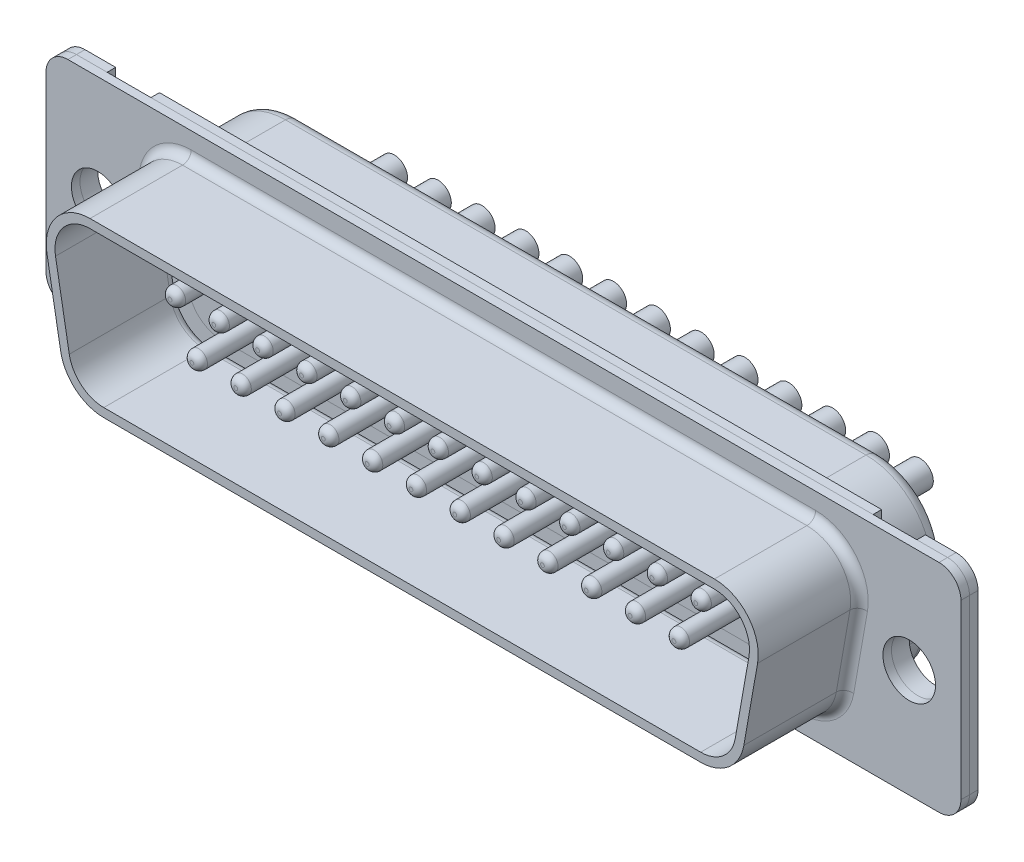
from build123d import *

# Parameters (mm, degrees)
EXTRUDE1_DEPTH                      = 0.4953
EXTRUDE2_DEPTH                      = 5.8674
F_31_0_12_DIAMETER_HOLE1_D          = 3.048
CUT_EXTRUDE1_DEPTH                  = 28.87418266
FILLET1_R                           = 0.508
FILLET2_R                           = 0.508
EXTRUDE3_DEPTH                      = 0.4953
SKETCH7_W                           = 1.524
SKETCH7_H                           = 0.4953
F_31_0_12_DIAMETER_HOLE2_AT_2_COUNT = 2
F_31_0_12_DIAMETER_HOLE2_AT_2_PITCH = 47.0408
EXTRUDE4_DEPTH                      = 3.9624
EXTRUDE5_START                      = 0.5334
SKETCH10_R                          = 2.31775
SKETCH10_R_2                        = 1.524
EXTRUDE5_DEPTH                      = 0.5334
CUT_EXTRUDE2_DEPTH                  = 3.9624
FILLET3_R                           = 0.762
CUT_EXTRUDE3_DEPTH                  = 29.099392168
EXTRUDE7_DEPTH                      = 4.8133
CUT_EXTRUDE4_DEPTH                  = 3.81
SKETCH16_R                          = 1.0795
CUT_EXTRUDE5_DEPTH                  = 1.0033
EXTRUDE8_DEPTH                      = 3.81
SKETCH18_R                          = 0.762
SKETCH18_R_2                        = 0.5588
EXTRUDE10_DEPTH                     = 3.6068
SKETCH19_R                          = 0.508
EXTRUDE11_DEPTH                     = 5.588
FILLET4_R                           = 0.396875
LPATTERN1_COUNT                     = 13
LPATTERN1_PITCH                     = 2.54
LPATTERN2_COUNT                     = 12
LPATTERN2_PITCH                     = 2.54


with BuildPart() as part:
    # Sketch1 → Extrude1 (new body)
    with BuildSketch(Plane.XY):
        with BuildLine():
            Line((-25.2476, -6.2738), (25.2476, -6.2738))
            ThreePointArc((25.2476, -6.2738), (26.145625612, -5.901825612), (26.5176, -5.0038))
            Line((26.5176, -5.0038), (26.5176, 5.0038))
            ThreePointArc((26.5176, 5.0038), (26.145625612, 5.901825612), (25.2476, 6.2738))
            Line((25.2476, 6.2738), (-25.2476, 6.2738))
            ThreePointArc((-25.2476, 6.2738), (-26.145625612, 5.901825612), (-26.5176, 5.0038))
            Line((-26.5176, 5.0038), (-26.5176, -5.0038))
            ThreePointArc((-26.5176, -5.0038), (-26.145625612, -5.901825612), (-25.2476, -6.2738))
        make_face()
    extrude(amount=-EXTRUDE1_DEPTH)

    # Sketch2 → Extrude2 (add)
    with BuildSketch(Plane.XY):
        with BuildLine():
            Line((20.598911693, 1.819533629), (19.801702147, -2.701666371))
            ThreePointArc((19.801702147, -2.701666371), (18.932970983, -4.206352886), (17.300290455, -4.8006))
            Line((17.300290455, -4.8006), (-17.300290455, -4.8006))
            ThreePointArc((-17.300290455, -4.8006), (-18.932970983, -4.206352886), (-19.801702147, -2.701666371))
            Line((-19.801702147, -2.701666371), (-20.598911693, 1.819533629))
            ThreePointArc((-20.598911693, 1.819533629), (-20.043252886, 3.893280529), (-18.0975, 4.8006))
            Line((-18.0975, 4.8006), (18.0975, 4.8006))
            ThreePointArc((18.0975, 4.8006), (20.043252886, 3.893280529), (20.598911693, 1.819533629))
        make_face()
        with BuildLine():
            Line((-18.0975, 4.2926), (18.0975, 4.2926))
            ThreePointArc((18.0975, 4.2926), (19.654102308, 3.566744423), (20.098629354, 1.907746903))
            Line((20.098629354, 1.907746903), (19.301419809, -2.613453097))
            ThreePointArc((19.301419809, -2.613453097), (18.606434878, -3.817202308), (17.300290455, -4.2926))
            Line((17.300290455, -4.2926), (-17.300290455, -4.2926))
            ThreePointArc((-17.300290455, -4.2926), (-18.606434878, -3.817202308), (-19.301419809, -2.613453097))
            Line((-19.301419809, -2.613453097), (-20.098629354, 1.907746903))
            ThreePointArc((-20.098629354, 1.907746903), (-19.654102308, 3.566744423), (-18.0975, 4.2926))
        make_face(mode=Mode.SUBTRACT)
    extrude(amount=EXTRUDE2_DEPTH)

    # 31 _0.12_ Diameter Hole1 (through all)
    with Locations(Plane.XY):
        with Locations((-23.5204, 0), (23.5204, 0)):
            Hole(F_31_0_12_DIAMETER_HOLE1_D / 2)

    # Sketch5 → Cut-Extrude1 (cut, through all)
    with BuildSketch(Plane.XY):
        with BuildLine():
            Line((18.0975, 4.2926), (-18.0975, 4.2926))
            ThreePointArc((-18.0975, 4.2926), (-19.654102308, 3.566744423), (-20.098629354, 1.907746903))
            Line((-20.098629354, 1.907746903), (-19.301419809, -2.613453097))
            ThreePointArc((-19.301419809, -2.613453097), (-18.606434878, -3.817202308), (-17.300290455, -4.2926))
            Line((-17.300290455, -4.2926), (17.300290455, -4.2926))
            ThreePointArc((17.300290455, -4.2926), (18.606434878, -3.817202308), (19.301419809, -2.613453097))
            Line((19.301419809, -2.613453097), (20.098629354, 1.907746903))
            ThreePointArc((20.098629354, 1.907746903), (19.654102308, 3.566744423), (18.0975, 4.2926))
        make_face()
    extrude(amount=-CUT_EXTRUDE1_DEPTH, mode=Mode.SUBTRACT)

    # Fillet1
    fillet1_edges = [part.edges().sort_by_distance(p)[0] for p in [
        (20.043252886, 3.893280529, 0),
        (0, 4.8006, 0),
        (-20.043252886, 3.893280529, 0),
        (-20.20030692, -0.441066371, 0),
        (-18.932970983, -4.206352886, 0),
        (0, -4.8006, 0),
        (18.932970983, -4.206352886, 0),
        (20.20030692, -0.441066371, 0),
    ]]
    fillet(fillet1_edges, radius=FILLET1_R)

    # Fillet2
    fillet2_edges = [part.edges().sort_by_distance(p)[0] for p in [
        (19.654102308, 3.566744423, -0.4953),
        (19.700024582, -0.352853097, -0.4953),
        (18.606434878, -3.817202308, -0.4953),
        (0, -4.2926, -0.4953),
        (-18.606434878, -3.817202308, -0.4953),
        (-19.700024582, -0.352853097, -0.4953),
        (-19.654102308, 3.566744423, -0.4953),
        (0, 4.2926, -0.4953),
    ]]
    fillet(fillet2_edges, radius=FILLET2_R)


with BuildPart() as body_2:
    # Sketch6 → Extrude3 (new body)
    with BuildSketch(Plane(origin=(0, 0, -0.4953), x_dir=(-1, 0, 0), z_dir=(0, 0, -1))):
        with BuildLine():
            Line((-23.4696, -6.2738), (-23.4696, -4.6228))
            Line((-23.4696, -4.6228), (-20.9296, -4.6228))
            Line((-20.9296, -4.6228), (-20.9296, -6.2738))
            Line((-20.9296, -6.2738), (20.9296, -6.2738))
            Line((20.9296, -6.2738), (20.9296, -4.6228))
            Line((20.9296, -4.6228), (23.4696, -4.6228))
            Line((23.4696, -4.6228), (23.4696, -6.2738))
            Line((23.4696, -6.2738), (25.2476, -6.2738))
            ThreePointArc((25.2476, -6.2738), (26.145625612, -5.901825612), (26.5176, -5.0038))
            Line((26.5176, -5.0038), (26.5176, 5.0038))
            ThreePointArc((26.5176, 5.0038), (26.145625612, 5.901825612), (25.2476, 6.2738))
            Line((25.2476, 6.2738), (23.4696, 6.2738))
            Line((23.4696, 6.2738), (23.4696, 4.6228))
            Line((23.4696, 4.6228), (20.9296, 4.6228))
            Line((20.9296, 4.6228), (20.9296, 6.2738))
            Line((20.9296, 6.2738), (-20.9296, 6.2738))
            Line((-20.9296, 6.2738), (-20.9296, 4.6228))
            Line((-20.9296, 4.6228), (-23.4696, 4.6228))
            Line((-23.4696, 4.6228), (-23.4696, 6.2738))
            Line((-23.4696, 6.2738), (-25.2476, 6.2738))
            ThreePointArc((-25.2476, 6.2738), (-26.145625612, 5.901825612), (-26.5176, 5.0038))
            Line((-26.5176, 5.0038), (-26.5176, -5.0038))
            ThreePointArc((-26.5176, -5.0038), (-26.145625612, -5.901825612), (-25.2476, -6.2738))
            Line((-25.2476, -6.2738), (-23.4696, -6.2738))
        make_face()
    extrude(amount=EXTRUDE3_DEPTH)

    # Sketch7 → 31 _0.12_ Diameter Hole2 (revolve, cut)
    with BuildSketch(Plane(origin=(-23.5204, 0, -0.4953), x_dir=(0, -1, 0), z_dir=(1, 0, 0))):
        with Locations((0.762, 0.24765)):
            Rectangle(SKETCH7_W, SKETCH7_H)
    f_31_0_12_diameter_hole2 = revolve(axis=Axis((-23.5204, 0, 5.8547), (0, 0, -1)), mode=Mode.SUBTRACT)

    # 31 _0.12_ Diameter Hole2 at 2: 31 _0.12_ Diameter Hole2 ×2
    with Locations(*[(i * F_31_0_12_DIAMETER_HOLE2_AT_2_PITCH, 0, 0) for i in range(1, F_31_0_12_DIAMETER_HOLE2_AT_2_COUNT)]):
        add(f_31_0_12_diameter_hole2, mode=Mode.SUBTRACT)

    # Sketch9 → Extrude4 (add)
    with BuildSketch(Plane(origin=(0, 0, -0.9906), x_dir=(-1, 0, 0), z_dir=(0, 0, -1))):
        with BuildLine():
            Line((-20.579617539, 0.887800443), (-20.033215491, -2.210999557))
            ThreePointArc((-20.033215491, -2.210999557), (-18.730118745, -4.468029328), (-16.281097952, -5.3594))
            Line((-16.281097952, -5.3594), (16.281097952, -5.3594))
            ThreePointArc((16.281097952, -5.3594), (18.730118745, -4.468029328), (20.033215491, -2.210999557))
            Line((20.033215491, -2.210999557), (20.579617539, 0.887800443))
            ThreePointArc((20.579617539, 0.887800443), (19.746129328, 3.998420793), (16.8275, 5.3594))
            Line((16.8275, 5.3594), (-16.8275, 5.3594))
            ThreePointArc((-16.8275, 5.3594), (-19.746129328, 3.998420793), (-20.579617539, 0.887800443))
        make_face()
    extrude(amount=EXTRUDE4_DEPTH)

    # Sketch10 → Extrude5 (add)
    # profile 1 of 2: a face of its own
    with BuildSketch(Plane(origin=(0, 0, -0.9906), x_dir=(-1, 0, 0), z_dir=(0, 0, -1)).offset(EXTRUDE5_START)):
        with Locations(Location((-23.5204, 0, 0), (0, 0, 180))):
            Circle(SKETCH10_R)
        with Locations(Location((-23.5204, 0, 0), (0, 0, 180))):
            Circle(SKETCH10_R_2, mode=Mode.SUBTRACT)
    # profile 2 of 2: a face of its own
    with BuildSketch(Plane(origin=(0, 0, -0.9906), x_dir=(-1, 0, 0), z_dir=(0, 0, -1)).offset(EXTRUDE5_START)):
        with Locations(Location((23.5204, 0, 0), (0, 0, 180))):
            Circle(SKETCH10_R)
        with Locations(Location((23.5204, 0, 0), (0, 0, 180))):
            Circle(SKETCH10_R_2, mode=Mode.SUBTRACT)
    extrude(amount=-EXTRUDE5_DEPTH)

    # Sketch11 → Cut-Extrude2 (cut)
    with BuildSketch(Plane(origin=(0, 0, -4.953), x_dir=(-1, 0, 0), z_dir=(0, 0, -1))):
        with BuildLine():
            Line((17.539476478, 3.8354), (-17.539476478, 3.8354))
            ThreePointArc((-17.539476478, 3.8354), (-18.998791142, 3.154910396), (-19.415535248, 1.599600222))
            Line((-19.415535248, 1.599600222), (-18.734772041, -2.261199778))
            ThreePointArc((-18.734772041, -2.261199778), (-18.083223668, -3.389714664), (-16.858713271, -3.8354))
            Line((-16.858713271, -3.8354), (16.858713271, -3.8354))
            ThreePointArc((16.858713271, -3.8354), (18.083223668, -3.389714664), (18.734772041, -2.261199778))
            Line((18.734772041, -2.261199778), (19.415535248, 1.599600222))
            ThreePointArc((19.415535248, 1.599600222), (18.998791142, 3.154910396), (17.539476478, 3.8354))
        make_face()
    extrude(amount=-CUT_EXTRUDE2_DEPTH, mode=Mode.SUBTRACT)

    # Fillet3
    fillet3_edges = [body_2.edges().sort_by_distance(p)[0] for p in [
        (0, 5.3594, -4.953),
        (19.746129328, 3.998420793, -4.953),
        (20.306416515, -0.661599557, -4.953),
        (18.730118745, -4.468029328, -4.953),
        (0, -5.3594, -4.953),
        (-18.730118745, -4.468029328, -4.953),
        (-20.306416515, -0.661599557, -4.953),
        (-19.746129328, 3.998420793, -4.953),
    ]]
    fillet(fillet3_edges, radius=FILLET3_R)

    # Sketch14 → Cut-Extrude3 (cut, through all)
    with BuildSketch(Plane(origin=(0, 0, -0.9906), x_dir=(-1, 0, 0), z_dir=(0, 0, -1))):
        with BuildLine():
            Line((17.539476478, 3.8354), (-17.539476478, 3.8354))
            ThreePointArc((-17.539476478, 3.8354), (-18.998791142, 3.154910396), (-19.415535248, 1.599600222))
            Line((-19.415535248, 1.599600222), (-18.734772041, -2.261199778))
            ThreePointArc((-18.734772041, -2.261199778), (-18.083223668, -3.389714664), (-16.858713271, -3.8354))
            Line((-16.858713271, -3.8354), (16.858713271, -3.8354))
            ThreePointArc((16.858713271, -3.8354), (18.083223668, -3.389714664), (18.734772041, -2.261199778))
            Line((18.734772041, -2.261199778), (19.415535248, 1.599600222))
            ThreePointArc((19.415535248, 1.599600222), (18.998791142, 3.154910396), (17.539476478, 3.8354))
        make_face()
    extrude(amount=-CUT_EXTRUDE3_DEPTH, mode=Mode.SUBTRACT)


with BuildPart() as body_3:
    # Sketch13 → Extrude7 (new body)
    with BuildSketch(Plane(origin=(0, 0, -0.4953), x_dir=(-1, 0, 0), z_dir=(0, 0, -1))):
        with BuildLine():
            Line((17.539476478, 3.8354), (-17.539476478, 3.8354))
            ThreePointArc((-17.539476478, 3.8354), (-18.998791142, 3.154910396), (-19.415535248, 1.599600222))
            Line((-19.415535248, 1.599600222), (-18.734772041, -2.261199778))
            ThreePointArc((-18.734772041, -2.261199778), (-18.083223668, -3.389714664), (-16.858713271, -3.8354))
            Line((-16.858713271, -3.8354), (16.858713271, -3.8354))
            ThreePointArc((16.858713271, -3.8354), (18.083223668, -3.389714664), (18.734772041, -2.261199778))
            Line((18.734772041, -2.261199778), (19.415535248, 1.599600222))
            ThreePointArc((19.415535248, 1.599600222), (18.998791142, 3.154910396), (17.539476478, 3.8354))
        make_face()
    extrude(amount=EXTRUDE7_DEPTH)

    # Sketch15 → Cut-Extrude4 (cut)
    with BuildSketch(Plane(origin=(0, 0, -5.3086), x_dir=(-1, 0, 0), z_dir=(0, 0, -1))):
        with BuildLine():
            Line((-16.1798, 1.801127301), (-16.1798, 0.738872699))
            ThreePointArc((-16.1798, 0.738872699), (-15.24, 0.1905), (-14.3002, 0.738872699))
            Line((-14.3002, 0.738872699), (-14.3002, 1.801127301))
            ThreePointArc((-14.3002, 1.801127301), (-15.24, 2.3495), (-16.1798, 1.801127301))
        make_face()
        with BuildLine():
            Line((-11.7602, 1.801127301), (-11.7602, 0.738872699))
            ThreePointArc((-11.7602, 0.738872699), (-12.7, 0.1905), (-13.6398, 0.738872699))
            Line((-13.6398, 0.738872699), (-13.6398, 1.801127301))
            ThreePointArc((-13.6398, 1.801127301), (-12.7, 2.3495), (-11.7602, 1.801127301))
        make_face()
        with BuildLine():
            Line((-9.2202, 1.801127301), (-9.2202, 0.738872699))
            ThreePointArc((-9.2202, 0.738872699), (-10.16, 0.1905), (-11.0998, 0.738872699))
            Line((-11.0998, 0.738872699), (-11.0998, 1.801127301))
            ThreePointArc((-11.0998, 1.801127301), (-10.16, 2.3495), (-9.2202, 1.801127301))
        make_face()
        with BuildLine():
            Line((-6.6802, 1.801127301), (-6.6802, 0.738872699))
            ThreePointArc((-6.6802, 0.738872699), (-7.62, 0.1905), (-8.5598, 0.738872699))
            Line((-8.5598, 0.738872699), (-8.5598, 1.801127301))
            ThreePointArc((-8.5598, 1.801127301), (-7.62, 2.3495), (-6.6802, 1.801127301))
        make_face()
        with BuildLine():
            Line((-4.1402, 1.801127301), (-4.1402, 0.738872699))
            ThreePointArc((-4.1402, 0.738872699), (-5.08, 0.1905), (-6.0198, 0.738872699))
            Line((-6.0198, 0.738872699), (-6.0198, 1.801127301))
            ThreePointArc((-6.0198, 1.801127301), (-5.08, 2.3495), (-4.1402, 1.801127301))
        make_face()
        with BuildLine():
            Line((-1.6002, 1.801127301), (-1.6002, 0.738872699))
            ThreePointArc((-1.6002, 0.738872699), (-2.54, 0.1905), (-3.4798, 0.738872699))
            Line((-3.4798, 0.738872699), (-3.4798, 1.801127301))
            ThreePointArc((-3.4798, 1.801127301), (-2.54, 2.3495), (-1.6002, 1.801127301))
        make_face()
        with BuildLine():
            Line((0.9398, 1.801127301), (0.9398, 0.738872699))
            ThreePointArc((0.9398, 0.738872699), (0, 0.1905), (-0.9398, 0.738872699))
            Line((-0.9398, 0.738872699), (-0.9398, 1.801127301))
            ThreePointArc((-0.9398, 1.801127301), (0, 2.3495), (0.9398, 1.801127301))
        make_face()
        with BuildLine():
            Line((3.4798, 1.801127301), (3.4798, 0.738872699))
            ThreePointArc((3.4798, 0.738872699), (2.54, 0.1905), (1.6002, 0.738872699))
            Line((1.6002, 0.738872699), (1.6002, 1.801127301))
            ThreePointArc((1.6002, 1.801127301), (2.54, 2.3495), (3.4798, 1.801127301))
        make_face()
        with BuildLine():
            Line((6.0198, 1.801127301), (6.0198, 0.738872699))
            ThreePointArc((6.0198, 0.738872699), (5.08, 0.1905), (4.1402, 0.738872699))
            Line((4.1402, 0.738872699), (4.1402, 1.801127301))
            ThreePointArc((4.1402, 1.801127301), (5.08, 2.3495), (6.0198, 1.801127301))
        make_face()
        with BuildLine():
            Line((8.5598, 1.801127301), (8.5598, 0.738872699))
            ThreePointArc((8.5598, 0.738872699), (7.62, 0.1905), (6.6802, 0.738872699))
            Line((6.6802, 0.738872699), (6.6802, 1.801127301))
            ThreePointArc((6.6802, 1.801127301), (7.62, 2.3495), (8.5598, 1.801127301))
        make_face()
        with BuildLine():
            Line((11.0998, 1.801127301), (11.0998, 0.738872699))
            ThreePointArc((11.0998, 0.738872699), (10.16, 0.1905), (9.2202, 0.738872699))
            Line((9.2202, 0.738872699), (9.2202, 1.801127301))
            ThreePointArc((9.2202, 1.801127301), (10.16, 2.3495), (11.0998, 1.801127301))
        make_face()
        with BuildLine():
            Line((13.6398, 1.801127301), (13.6398, 0.738872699))
            ThreePointArc((13.6398, 0.738872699), (12.7, 0.1905), (11.7602, 0.738872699))
            Line((11.7602, 0.738872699), (11.7602, 1.801127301))
            ThreePointArc((11.7602, 1.801127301), (12.7, 2.3495), (13.6398, 1.801127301))
        make_face()
        with BuildLine():
            Line((16.1798, 1.801127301), (16.1798, 0.738872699))
            ThreePointArc((16.1798, 0.738872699), (15.24, 0.1905), (14.3002, 0.738872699))
            Line((14.3002, 0.738872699), (14.3002, 1.801127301))
            ThreePointArc((14.3002, 1.801127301), (15.24, 2.3495), (16.1798, 1.801127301))
        make_face()
        with BuildLine():
            Line((-13.0302, -0.738872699), (-13.0302, -1.801127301))
            ThreePointArc((-13.0302, -1.801127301), (-13.97, -2.3495), (-14.9098, -1.801127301))
            Line((-14.9098, -1.801127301), (-14.9098, -0.738872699))
            ThreePointArc((-14.9098, -0.738872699), (-13.97, -0.1905), (-13.0302, -0.738872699))
        make_face()
        with BuildLine():
            Line((-10.4902, -0.738872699), (-10.4902, -1.801127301))
            ThreePointArc((-10.4902, -1.801127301), (-11.43, -2.3495), (-12.3698, -1.801127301))
            Line((-12.3698, -1.801127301), (-12.3698, -0.738872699))
            ThreePointArc((-12.3698, -0.738872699), (-11.43, -0.1905), (-10.4902, -0.738872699))
        make_face()
        with BuildLine():
            Line((-7.9502, -0.738872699), (-7.9502, -1.801127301))
            ThreePointArc((-7.9502, -1.801127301), (-8.89, -2.3495), (-9.8298, -1.801127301))
            Line((-9.8298, -1.801127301), (-9.8298, -0.738872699))
            ThreePointArc((-9.8298, -0.738872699), (-8.89, -0.1905), (-7.9502, -0.738872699))
        make_face()
        with BuildLine():
            Line((-5.4102, -0.738872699), (-5.4102, -1.801127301))
            ThreePointArc((-5.4102, -1.801127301), (-6.35, -2.3495), (-7.2898, -1.801127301))
            Line((-7.2898, -1.801127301), (-7.2898, -0.738872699))
            ThreePointArc((-7.2898, -0.738872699), (-6.35, -0.1905), (-5.4102, -0.738872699))
        make_face()
        with BuildLine():
            Line((-2.8702, -0.738872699), (-2.8702, -1.801127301))
            ThreePointArc((-2.8702, -1.801127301), (-3.81, -2.3495), (-4.7498, -1.801127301))
            Line((-4.7498, -1.801127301), (-4.7498, -0.738872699))
            ThreePointArc((-4.7498, -0.738872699), (-3.81, -0.1905), (-2.8702, -0.738872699))
        make_face()
        with BuildLine():
            Line((-0.3302, -0.738872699), (-0.3302, -1.801127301))
            ThreePointArc((-0.3302, -1.801127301), (-1.27, -2.3495), (-2.2098, -1.801127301))
            Line((-2.2098, -1.801127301), (-2.2098, -0.738872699))
            ThreePointArc((-2.2098, -0.738872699), (-1.27, -0.1905), (-0.3302, -0.738872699))
        make_face()
        with BuildLine():
            Line((2.2098, -0.738872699), (2.2098, -1.801127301))
            ThreePointArc((2.2098, -1.801127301), (1.27, -2.3495), (0.3302, -1.801127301))
            Line((0.3302, -1.801127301), (0.3302, -0.738872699))
            ThreePointArc((0.3302, -0.738872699), (1.27, -0.1905), (2.2098, -0.738872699))
        make_face()
        with BuildLine():
            Line((4.7498, -0.738872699), (4.7498, -1.801127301))
            ThreePointArc((4.7498, -1.801127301), (3.81, -2.3495), (2.8702, -1.801127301))
            Line((2.8702, -1.801127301), (2.8702, -0.738872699))
            ThreePointArc((2.8702, -0.738872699), (3.81, -0.1905), (4.7498, -0.738872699))
        make_face()
        with BuildLine():
            Line((7.2898, -0.738872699), (7.2898, -1.801127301))
            ThreePointArc((7.2898, -1.801127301), (6.35, -2.3495), (5.4102, -1.801127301))
            Line((5.4102, -1.801127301), (5.4102, -0.738872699))
            ThreePointArc((5.4102, -0.738872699), (6.35, -0.1905), (7.2898, -0.738872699))
        make_face()
        with BuildLine():
            Line((9.8298, -0.738872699), (9.8298, -1.801127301))
            ThreePointArc((9.8298, -1.801127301), (8.89, -2.3495), (7.9502, -1.801127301))
            Line((7.9502, -1.801127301), (7.9502, -0.738872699))
            ThreePointArc((7.9502, -0.738872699), (8.89, -0.1905), (9.8298, -0.738872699))
        make_face()
        with BuildLine():
            Line((12.3698, -0.738872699), (12.3698, -1.801127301))
            ThreePointArc((12.3698, -1.801127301), (11.43, -2.3495), (10.4902, -1.801127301))
            Line((10.4902, -1.801127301), (10.4902, -0.738872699))
            ThreePointArc((10.4902, -0.738872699), (11.43, -0.1905), (12.3698, -0.738872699))
        make_face()
        with BuildLine():
            Line((14.9098, -0.738872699), (14.9098, -1.801127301))
            ThreePointArc((14.9098, -1.801127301), (13.97, -2.3495), (13.0302, -1.801127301))
            Line((13.0302, -1.801127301), (13.0302, -0.738872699))
            ThreePointArc((13.0302, -0.738872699), (13.97, -0.1905), (14.9098, -0.738872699))
        make_face()
    extrude(amount=-CUT_EXTRUDE4_DEPTH, mode=Mode.SUBTRACT)

    # Sketch16 → Cut-Extrude5 (cut)
    with BuildSketch(Plane.XY.offset(-0.4953)):
        with Locations(Location((-15.24, 1.27, 0), (0, 0, 150.527068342))):
            Circle(SKETCH16_R)
        with Locations(Location((-12.7, 1.27, 0), (0, 0, 209.472931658))):
            Circle(SKETCH16_R)
        with Locations(Location((-10.16, 1.27, 0), (0, 0, 209.472931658))):
            Circle(SKETCH16_R)
        with Locations(Location((-7.62, 1.27, 0), (0, 0, 209.472931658))):
            Circle(SKETCH16_R)
        with Locations(Location((-5.08, 1.27, 0), (0, 0, 209.472931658))):
            Circle(SKETCH16_R)
        with Locations(Location((-2.54, 1.27, 0), (0, 0, 209.472931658))):
            Circle(SKETCH16_R)
        with Locations(Location((0, 1.27, 0), (0, 0, 150.527068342))):
            Circle(SKETCH16_R)
        with Locations(Location((2.54, 1.27, 0), (0, 0, 150.527068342))):
            Circle(SKETCH16_R)
        with Locations(Location((5.08, 1.27, 0), (0, 0, 150.527068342))):
            Circle(SKETCH16_R)
        with Locations(Location((7.62, 1.27, 0), (0, 0, 150.527068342))):
            Circle(SKETCH16_R)
        with Locations(Location((10.16, 1.27, 0), (0, 0, 150.527068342))):
            Circle(SKETCH16_R)
        with Locations(Location((12.7, 1.27, 0), (0, 0, 150.527068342))):
            Circle(SKETCH16_R)
        with Locations(Location((15.24, 1.27, 0), (0, 0, 209.472931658))):
            Circle(SKETCH16_R)
        with Locations(Location((13.97, -1.27, 0), (0, 0, 150.527068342))):
            Circle(SKETCH16_R)
        with Locations(Location((11.43, -1.27, 0), (0, 0, 150.527068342))):
            Circle(SKETCH16_R)
        with Locations(Location((8.89, -1.27, 0), (0, 0, 150.527068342))):
            Circle(SKETCH16_R)
        with Locations(Location((6.35, -1.27, 0), (0, 0, 150.527068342))):
            Circle(SKETCH16_R)
        with Locations(Location((3.81, -1.27, 0), (0, 0, 150.527068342))):
            Circle(SKETCH16_R)
        with Locations(Location((1.27, -1.27, 0), (0, 0, 150.527068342))):
            Circle(SKETCH16_R)
        with Locations(Location((-1.27, -1.27, 0), (0, 0, 150.527068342))):
            Circle(SKETCH16_R)
        with Locations(Location((-3.81, -1.27, 0), (0, 0, 150.527068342))):
            Circle(SKETCH16_R)
        with Locations(Location((-6.35, -1.27, 0), (0, 0, 150.527068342))):
            Circle(SKETCH16_R)
        with Locations(Location((-8.89, -1.27, 0), (0, 0, 150.527068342))):
            Circle(SKETCH16_R)
        with Locations(Location((-11.43, -1.27, 0), (0, 0, 150.527068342))):
            Circle(SKETCH16_R)
        with Locations(Location((-13.97, -1.27, 0), (0, 0, 150.527068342))):
            Circle(SKETCH16_R)
    extrude(amount=-CUT_EXTRUDE5_DEPTH, mode=Mode.SUBTRACT)


with BuildPart() as body_4:
    # Sketch17 → Extrude8 (new body)
    with BuildSketch(Plane(origin=(0, 0, -5.3086), x_dir=(-1, 0, 0), z_dir=(0, 0, -1))):
        with BuildLine():
            Line((-16.1798, 1.801127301), (-16.1798, 0.738872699))
            ThreePointArc((-16.1798, 0.738872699), (-15.24, 0.1905), (-14.3002, 0.738872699))
            Line((-14.3002, 0.738872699), (-14.3002, 1.801127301))
            ThreePointArc((-14.3002, 1.801127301), (-15.24, 2.3495), (-16.1798, 1.801127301))
        make_face()
    extrude(amount=-EXTRUDE8_DEPTH)

    # Sketch18 → Extrude10 (add)
    with BuildSketch(Plane(origin=(0, 0, -5.3086), x_dir=(-1, 0, 0), z_dir=(0, 0, -1))):
        with Locations((-15.24, 1.27)):
            Circle(SKETCH18_R)
        with Locations((-15.24, 1.27)):
            Circle(SKETCH18_R_2, mode=Mode.SUBTRACT)
    extrude(amount=EXTRUDE10_DEPTH)

    # Sketch19 → Extrude11 (add)
    with BuildSketch(Plane.XY.offset(-1.4986)):
        with Locations(Location((15.24, 1.27, 0), (0, 0, 180))):
            Circle(SKETCH19_R)
    extrude(amount=EXTRUDE11_DEPTH)

    # Fillet4
    fillet4_edges = [body_4.edges().sort_by_distance(p)[0] for p in [
        (15.748, 1.27, 4.0894),
    ]]
    fillet(fillet4_edges, radius=FILLET4_R)


with BuildPart() as lpattern1_1:
    # LPattern1: pattern copy
    add(body_4.part.moved(Location(Vector(-1, 0, 0) * (1 * LPATTERN1_PITCH))))


with BuildPart() as lpattern1_2:
    # LPattern1: pattern copy
    add(body_4.part.moved(Location(Vector(-1, 0, 0) * (2 * LPATTERN1_PITCH))))


with BuildPart() as lpattern1_3:
    # LPattern1: pattern copy
    add(body_4.part.moved(Location(Vector(-1, 0, 0) * (3 * LPATTERN1_PITCH))))


with BuildPart() as lpattern1_4:
    # LPattern1: pattern copy
    add(body_4.part.moved(Location(Vector(-1, 0, 0) * (4 * LPATTERN1_PITCH))))


with BuildPart() as lpattern1_5:
    # LPattern1: pattern copy
    add(body_4.part.moved(Location(Vector(-1, 0, 0) * (5 * LPATTERN1_PITCH))))


with BuildPart() as lpattern1_6:
    # LPattern1: pattern copy
    add(body_4.part.moved(Location(Vector(-1, 0, 0) * (6 * LPATTERN1_PITCH))))


with BuildPart() as lpattern1_7:
    # LPattern1: pattern copy
    add(body_4.part.moved(Location(Vector(-1, 0, 0) * (7 * LPATTERN1_PITCH))))


with BuildPart() as lpattern1_8:
    # LPattern1: pattern copy
    add(body_4.part.moved(Location(Vector(-1, 0, 0) * (8 * LPATTERN1_PITCH))))


with BuildPart() as lpattern1_9:
    # LPattern1: pattern copy
    add(body_4.part.moved(Location(Vector(-1, 0, 0) * (9 * LPATTERN1_PITCH))))


with BuildPart() as lpattern1_10:
    # LPattern1: pattern copy
    add(body_4.part.moved(Location(Vector(-1, 0, 0) * (10 * LPATTERN1_PITCH))))


with BuildPart() as lpattern1_11:
    # LPattern1: pattern copy
    add(body_4.part.moved(Location(Vector(-1, 0, 0) * (11 * LPATTERN1_PITCH))))


with BuildPart() as lpattern1_12:
    # LPattern1: pattern copy
    add(body_4.part.moved(Location(Vector(-1, 0, 0) * (12 * LPATTERN1_PITCH))))


with BuildPart() as body_17:
    # Body-Move_Copy1: copy of body 4
    add(body_4.part.moved(Location((-1.27, -2.54, 0))))


with BuildPart() as lpattern2_1:
    # LPattern2: pattern copy
    add(body_17.part.moved(Location(Vector(-1, 0, 0) * (1 * LPATTERN2_PITCH))))


with BuildPart() as lpattern2_2:
    # LPattern2: pattern copy
    add(body_17.part.moved(Location(Vector(-1, 0, 0) * (2 * LPATTERN2_PITCH))))


with BuildPart() as lpattern2_3:
    # LPattern2: pattern copy
    add(body_17.part.moved(Location(Vector(-1, 0, 0) * (3 * LPATTERN2_PITCH))))


with BuildPart() as lpattern2_4:
    # LPattern2: pattern copy
    add(body_17.part.moved(Location(Vector(-1, 0, 0) * (4 * LPATTERN2_PITCH))))


with BuildPart() as lpattern2_5:
    # LPattern2: pattern copy
    add(body_17.part.moved(Location(Vector(-1, 0, 0) * (5 * LPATTERN2_PITCH))))


with BuildPart() as lpattern2_6:
    # LPattern2: pattern copy
    add(body_17.part.moved(Location(Vector(-1, 0, 0) * (6 * LPATTERN2_PITCH))))


with BuildPart() as lpattern2_7:
    # LPattern2: pattern copy
    add(body_17.part.moved(Location(Vector(-1, 0, 0) * (7 * LPATTERN2_PITCH))))


with BuildPart() as lpattern2_8:
    # LPattern2: pattern copy
    add(body_17.part.moved(Location(Vector(-1, 0, 0) * (8 * LPATTERN2_PITCH))))


with BuildPart() as lpattern2_9:
    # LPattern2: pattern copy
    add(body_17.part.moved(Location(Vector(-1, 0, 0) * (9 * LPATTERN2_PITCH))))


with BuildPart() as lpattern2_10:
    # LPattern2: pattern copy
    add(body_17.part.moved(Location(Vector(-1, 0, 0) * (10 * LPATTERN2_PITCH))))


with BuildPart() as lpattern2_11:
    # LPattern2: pattern copy
    add(body_17.part.moved(Location(Vector(-1, 0, 0) * (11 * LPATTERN2_PITCH))))


solid = Compound([part.part, body_2.part, body_3.part, body_4.part, lpattern1_1.part, lpattern1_2.part, lpattern1_3.part, lpattern1_4.part, lpattern1_5.part, lpattern1_6.part, lpattern1_7.part, lpattern1_8.part, lpattern1_9.part, lpattern1_10.part, lpattern1_11.part, lpattern1_12.part, body_17.part, lpattern2_1.part, lpattern2_2.part, lpattern2_3.part, lpattern2_4.part, lpattern2_5.part, lpattern2_6.part, lpattern2_7.part, lpattern2_8.part, lpattern2_9.part, lpattern2_10.part, lpattern2_11.part])
